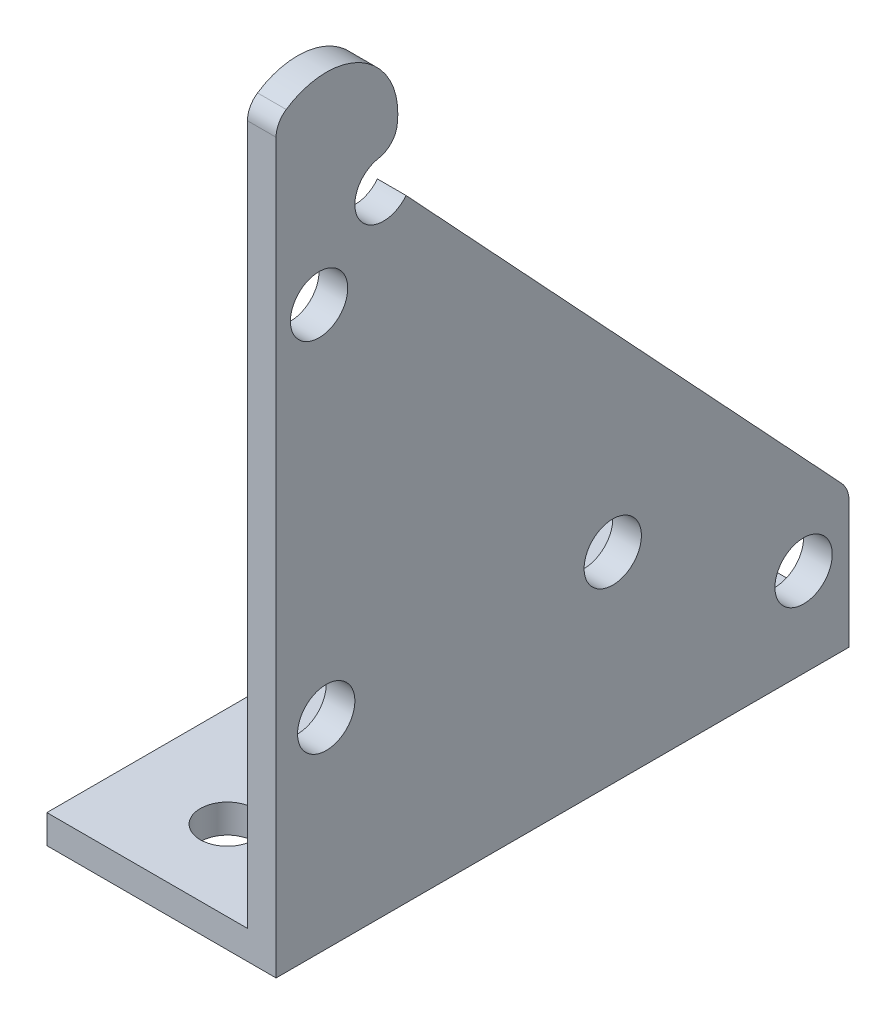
ISO-10303-21;
HEADER;
FILE_DESCRIPTION(('STEP AP214'),'2;1');
FILE_NAME('part.step','',(''),(''),'','','');
FILE_SCHEMA(('AUTOMOTIVE_DESIGN { 1 0 10303 214 1 1 1 1 }'));
ENDSEC;
DATA;
#1=APPLICATION_CONTEXT('core data for automotive mechanical design processes');
#2=APPLICATION_PROTOCOL_DEFINITION('international standard','automotive_design',2000,#1);
#3=PRODUCT_CONTEXT('',#1,'mechanical');
#4=PRODUCT('Part','Part','',(#3));
#5=PRODUCT_RELATED_PRODUCT_CATEGORY('part','',(#4));
#6=PRODUCT_DEFINITION_FORMATION('','',#4);
#7=PRODUCT_DEFINITION_CONTEXT('part definition',#1,'design');
#8=PRODUCT_DEFINITION('design','',#6,#7);
#9=PRODUCT_DEFINITION_SHAPE('','',#8);
#10=(LENGTH_UNIT() NAMED_UNIT(*) SI_UNIT(.MILLI.,.METRE.));
#11=(NAMED_UNIT(*) PLANE_ANGLE_UNIT() SI_UNIT($,.RADIAN.));
#12=(NAMED_UNIT(*) SI_UNIT($,.STERADIAN.) SOLID_ANGLE_UNIT());
#13=UNCERTAINTY_MEASURE_WITH_UNIT(LENGTH_MEASURE(1.E-05),#10,'distance_accuracy_value','');
#14=(GEOMETRIC_REPRESENTATION_CONTEXT(3) GLOBAL_UNCERTAINTY_ASSIGNED_CONTEXT((#13)) GLOBAL_UNIT_ASSIGNED_CONTEXT((#10,
#11,#12)) REPRESENTATION_CONTEXT('',''));
#15=CARTESIAN_POINT('',(0.,0.,0.));
#16=DIRECTION('',(0.,0.,1.));
#17=DIRECTION('',(1.,0.,0.));
#18=AXIS2_PLACEMENT_3D('',#15,#16,#17);
#19=CARTESIAN_POINT('',(3.175,0.,-63.5));
#20=DIRECTION('',(0.,0.,1.));
#21=DIRECTION('',(1.,0.,0.));
#22=AXIS2_PLACEMENT_3D('',#19,#20,#21);
#23=PLANE('',#22);
#24=DIRECTION('',(0.,1.,0.));
#25=VECTOR('',#24,1.);
#26=CARTESIAN_POINT('',(0.,0.,-63.5));
#27=LINE('',#26,#25);
#28=CARTESIAN_POINT('',(0.,3.175,-63.5));
#29=VERTEX_POINT('',#28);
#30=CARTESIAN_POINT('',(0.,13.9893342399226,-63.5));
#31=VERTEX_POINT('',#30);
#32=EDGE_CURVE('E153',#29,#31,#27,.T.);
#33=ORIENTED_EDGE('',*,*,#32,.T.);
#34=DIRECTION('',(-1.,0.,0.));
#35=VECTOR('',#34,1.);
#36=CARTESIAN_POINT('',(3.175,13.9893342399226,-63.5));
#37=LINE('',#36,#35);
#38=CARTESIAN_POINT('',(3.175,13.9893342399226,-63.5));
#39=VERTEX_POINT('',#38);
#40=EDGE_CURVE('E40',#31,#39,#37,.F.);
#41=ORIENTED_EDGE('',*,*,#40,.T.);
#42=DIRECTION('',(0.,1.,0.));
#43=VECTOR('',#42,1.);
#44=CARTESIAN_POINT('',(3.175,0.,-63.5));
#45=LINE('',#44,#43);
#46=CARTESIAN_POINT('',(3.175,0.,-63.5));
#47=VERTEX_POINT('',#46);
#48=EDGE_CURVE('E168',#47,#39,#45,.T.);
#49=ORIENTED_EDGE('',*,*,#48,.F.);
#50=DIRECTION('',(-1.,0.,0.));
#51=VECTOR('',#50,1.);
#52=CARTESIAN_POINT('',(3.175,0.,-63.5));
#53=LINE('',#52,#51);
#54=CARTESIAN_POINT('',(-22.225,0.,-63.5));
#55=VERTEX_POINT('',#54);
#56=EDGE_CURVE('E127',#47,#55,#53,.T.);
#57=ORIENTED_EDGE('',*,*,#56,.T.);
#58=DIRECTION('',(0.,-1.,0.));
#59=VECTOR('',#58,1.);
#60=CARTESIAN_POINT('',(-22.225,3.175,-63.5));
#61=LINE('',#60,#59);
#62=CARTESIAN_POINT('',(-22.225,3.175,-63.5));
#63=VERTEX_POINT('',#62);
#64=EDGE_CURVE('E135',#63,#55,#61,.T.);
#65=ORIENTED_EDGE('',*,*,#64,.F.);
#66=DIRECTION('',(-1.,0.,0.));
#67=VECTOR('',#66,1.);
#68=CARTESIAN_POINT('',(3.175,3.175,-63.5));
#69=LINE('',#68,#67);
#70=EDGE_CURVE('E137',#29,#63,#69,.T.);
#71=ORIENTED_EDGE('',*,*,#70,.F.);
#72=EDGE_LOOP('',(#33,#41,#49,#57,#65,#71));
#73=FACE_BOUND('',#72,.T.);
#74=ADVANCED_FACE('F33',(#73),#23,.F.);
#75=CARTESIAN_POINT('',(3.175,15.24,-63.5));
#76=DIRECTION('',(0.,-0.681998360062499,0.731353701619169));
#77=DIRECTION('',(0.,-0.73135370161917,-0.6819983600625));
#78=AXIS2_PLACEMENT_3D('',#75,#76,#77);
#79=PLANE('',#78);
#80=DIRECTION('',(0.,0.73135370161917,0.6819983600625));
#81=VECTOR('',#80,1.);
#82=CARTESIAN_POINT('',(3.175,15.24,-63.5));
#83=LINE('',#82,#81);
#84=CARTESIAN_POINT('',(3.175,16.154679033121,-62.6470480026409));
#85=VERTEX_POINT('',#84);
#86=CARTESIAN_POINT('',(3.175,67.8901727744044,-14.4029196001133));
#87=VERTEX_POINT('',#86);
#88=EDGE_CURVE('E170',#85,#87,#83,.T.);
#89=ORIENTED_EDGE('',*,*,#88,.F.);
#90=DIRECTION('',(-1.,0.,0.));
#91=VECTOR('',#90,1.);
#92=CARTESIAN_POINT('',(3.175,16.154679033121,-62.6470480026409));
#93=LINE('',#92,#91);
#94=CARTESIAN_POINT('',(0.,16.154679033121,-62.6470480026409));
#95=VERTEX_POINT('',#94);
#96=EDGE_CURVE('E200',#85,#95,#93,.T.);
#97=ORIENTED_EDGE('',*,*,#96,.T.);
#98=DIRECTION('',(0.,0.73135370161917,0.6819983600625));
#99=VECTOR('',#98,1.);
#100=CARTESIAN_POINT('',(0.,15.24,-63.5));
#101=LINE('',#100,#99);
#102=CARTESIAN_POINT('',(0.,67.8901727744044,-14.4029196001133));
#103=VERTEX_POINT('',#102);
#104=EDGE_CURVE('E156',#95,#103,#101,.T.);
#105=ORIENTED_EDGE('',*,*,#104,.T.);
#106=DIRECTION('',(-1.,0.,0.));
#107=VECTOR('',#106,1.);
#108=CARTESIAN_POINT('',(3.175,67.8901727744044,-14.4029196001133));
#109=LINE('',#108,#107);
#110=EDGE_CURVE('E195',#87,#103,#109,.T.);
#111=ORIENTED_EDGE('',*,*,#110,.F.);
#112=EDGE_LOOP('',(#89,#97,#105,#111));
#113=FACE_BOUND('',#112,.T.);
#114=ADVANCED_FACE('F206',(#113),#79,.F.);
#115=CARTESIAN_POINT('',(3.175,69.85,-11.90498));
#116=DIRECTION('',(-1.,0.,0.));
#117=DIRECTION('',(0.,0.,1.));
#118=AXIS2_PLACEMENT_3D('',#115,#116,#117);
#119=CYLINDRICAL_SURFACE('',#118,3.17499999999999);
#120=CARTESIAN_POINT('',(0.,69.85,-11.90498));
#121=DIRECTION('',(-1.,0.,0.));
#122=DIRECTION('',(0.,0.,1.));
#123=AXIS2_PLACEMENT_3D('',#120,#121,#122);
#124=CIRCLE('',#123,3.17499999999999);
#125=CARTESIAN_POINT('',(0.,72.9758991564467,-11.3487611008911));
#126=VERTEX_POINT('',#125);
#127=EDGE_CURVE('E158',#103,#126,#124,.T.);
#128=ORIENTED_EDGE('',*,*,#127,.T.);
#129=DIRECTION('',(-1.,0.,0.));
#130=VECTOR('',#129,1.);
#131=CARTESIAN_POINT('',(3.175,72.9758991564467,-11.3487611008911));
#132=LINE('',#131,#130);
#133=CARTESIAN_POINT('',(3.175,72.9758991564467,-11.3487611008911));
#134=VERTEX_POINT('',#133);
#135=EDGE_CURVE('E192',#134,#126,#132,.T.);
#136=ORIENTED_EDGE('',*,*,#135,.F.);
#137=CARTESIAN_POINT('',(3.175,69.85,-11.90498));
#138=DIRECTION('',(-1.,0.,0.));
#139=DIRECTION('',(0.,0.,1.));
#140=AXIS2_PLACEMENT_3D('',#137,#138,#139);
#141=CIRCLE('',#140,3.17499999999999);
#142=EDGE_CURVE('E172',#87,#134,#141,.T.);
#143=ORIENTED_EDGE('',*,*,#142,.F.);
#144=ORIENTED_EDGE('',*,*,#110,.T.);
#145=EDGE_LOOP('',(#128,#136,#143,#144));
#146=FACE_BOUND('',#145,.T.);
#147=ADVANCED_FACE('F216',(#146),#119,.F.);
#148=CARTESIAN_POINT('',(3.175,75.476618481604,-10.903785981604));
#149=DIRECTION('',(-1.,0.,0.));
#150=DIRECTION('',(0.,0.,1.));
#151=AXIS2_PLACEMENT_3D('',#148,#149,#150);
#152=CYLINDRICAL_SURFACE('',#151,2.54);
#153=CARTESIAN_POINT('',(0.,75.476618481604,-10.903785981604));
#154=DIRECTION('',(1.,0.,0.));
#155=DIRECTION('',(0.,0.,1.));
#156=AXIS2_PLACEMENT_3D('',#153,#154,#155);
#157=CIRCLE('',#156,2.54);
#158=CARTESIAN_POINT('',(0.,75.1362036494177,-13.4208711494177));
#159=VERTEX_POINT('',#158);
#160=EDGE_CURVE('E160',#126,#159,#157,.T.);
#161=ORIENTED_EDGE('',*,*,#160,.T.);
#162=DIRECTION('',(-1.,0.,0.));
#163=VECTOR('',#162,1.);
#164=CARTESIAN_POINT('',(3.175,75.1362036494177,-13.4208711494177));
#165=LINE('',#164,#163);
#166=CARTESIAN_POINT('',(3.175,75.1362036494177,-13.4208711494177));
#167=VERTEX_POINT('',#166);
#168=EDGE_CURVE('E189',#167,#159,#165,.T.);
#169=ORIENTED_EDGE('',*,*,#168,.F.);
#170=CARTESIAN_POINT('',(3.175,75.476618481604,-10.903785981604));
#171=DIRECTION('',(1.,0.,0.));
#172=DIRECTION('',(0.,0.,1.));
#173=AXIS2_PLACEMENT_3D('',#170,#171,#172);
#174=CIRCLE('',#173,2.54);
#175=EDGE_CURVE('E174',#134,#167,#174,.T.);
#176=ORIENTED_EDGE('',*,*,#175,.F.);
#177=ORIENTED_EDGE('',*,*,#135,.T.);
#178=EDGE_LOOP('',(#161,#169,#176,#177));
#179=FACE_BOUND('',#178,.T.);
#180=ADVANCED_FACE('F220',(#179),#152,.T.);
#181=CARTESIAN_POINT('',(3.175,76.2,-5.55498));
#182=DIRECTION('',(-1.,0.,0.));
#183=DIRECTION('',(0.,0.,1.));
#184=AXIS2_PLACEMENT_3D('',#181,#182,#183);
#185=CYLINDRICAL_SURFACE('',#184,7.9375);
#186=CARTESIAN_POINT('',(0.,76.2,-5.55498));
#187=DIRECTION('',(1.,0.,0.));
#188=DIRECTION('',(0.,0.,1.));
#189=AXIS2_PLACEMENT_3D('',#186,#187,#188);
#190=CIRCLE('',#189,7.9375);
#191=CARTESIAN_POINT('',(0.,82.7837205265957,-1.12118588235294));
#192=VERTEX_POINT('',#191);
#193=EDGE_CURVE('E162',#159,#192,#190,.T.);
#194=ORIENTED_EDGE('',*,*,#193,.T.);
#195=DIRECTION('',(-1.,0.,0.));
#196=VECTOR('',#195,1.);
#197=CARTESIAN_POINT('',(3.175,82.7837205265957,-1.12118588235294));
#198=LINE('',#197,#196);
#199=CARTESIAN_POINT('',(3.175,82.7837205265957,-1.12118588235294));
#200=VERTEX_POINT('',#199);
#201=EDGE_CURVE('E186',#200,#192,#198,.T.);
#202=ORIENTED_EDGE('',*,*,#201,.F.);
#203=CARTESIAN_POINT('',(3.175,76.2,-5.55498));
#204=DIRECTION('',(1.,0.,0.));
#205=DIRECTION('',(0.,0.,1.));
#206=AXIS2_PLACEMENT_3D('',#203,#204,#205);
#207=CIRCLE('',#206,7.9375);
#208=EDGE_CURVE('E176',#167,#200,#207,.T.);
#209=ORIENTED_EDGE('',*,*,#208,.F.);
#210=ORIENTED_EDGE('',*,*,#168,.T.);
#211=EDGE_LOOP('',(#194,#202,#209,#210));
#212=FACE_BOUND('',#211,.T.);
#213=ADVANCED_FACE('F254',(#212),#185,.T.);
#214=CARTESIAN_POINT('',(3.175,80.6769299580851,-2.54));
#215=DIRECTION('',(-1.,0.,0.));
#216=DIRECTION('',(0.,0.,1.));
#217=AXIS2_PLACEMENT_3D('',#214,#215,#216);
#218=CYLINDRICAL_SURFACE('',#217,2.54);
#219=CARTESIAN_POINT('',(0.,80.6769299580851,-2.54));
#220=DIRECTION('',(1.,0.,0.));
#221=DIRECTION('',(0.,0.,-1.));
#222=AXIS2_PLACEMENT_3D('',#219,#220,#221);
#223=CIRCLE('',#222,2.54);
#224=CARTESIAN_POINT('',(0.,80.6769299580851,0.));
#225=VERTEX_POINT('',#224);
#226=EDGE_CURVE('E164',#192,#225,#223,.T.);
#227=ORIENTED_EDGE('',*,*,#226,.T.);
#228=DIRECTION('',(-1.,0.,0.));
#229=VECTOR('',#228,1.);
#230=CARTESIAN_POINT('',(3.175,80.6769299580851,0.));
#231=LINE('',#230,#229);
#232=CARTESIAN_POINT('',(3.175,80.6769299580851,0.));
#233=VERTEX_POINT('',#232);
#234=EDGE_CURVE('E126',#233,#225,#231,.T.);
#235=ORIENTED_EDGE('',*,*,#234,.F.);
#236=CARTESIAN_POINT('',(3.175,80.6769299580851,-2.54));
#237=DIRECTION('',(1.,0.,0.));
#238=DIRECTION('',(0.,0.,-1.));
#239=AXIS2_PLACEMENT_3D('',#236,#237,#238);
#240=CIRCLE('',#239,2.54);
#241=EDGE_CURVE('E178',#200,#233,#240,.T.);
#242=ORIENTED_EDGE('',*,*,#241,.F.);
#243=ORIENTED_EDGE('',*,*,#201,.T.);
#244=EDGE_LOOP('',(#227,#235,#242,#243));
#245=FACE_BOUND('',#244,.T.);
#246=ADVANCED_FACE('F252',(#245),#218,.T.);
#247=CARTESIAN_POINT('',(3.175,0.,0.));
#248=DIRECTION('',(0.,0.,-1.));
#249=DIRECTION('',(-1.,0.,0.));
#250=AXIS2_PLACEMENT_3D('',#247,#248,#249);
#251=PLANE('',#250);
#252=DIRECTION('',(0.,-1.,0.));
#253=VECTOR('',#252,1.);
#254=CARTESIAN_POINT('',(0.,0.,0.));
#255=LINE('',#254,#253);
#256=CARTESIAN_POINT('',(0.,3.175,0.));
#257=VERTEX_POINT('',#256);
#258=EDGE_CURVE('E166',#225,#257,#255,.T.);
#259=ORIENTED_EDGE('',*,*,#258,.T.);
#260=DIRECTION('',(-1.,0.,0.));
#261=VECTOR('',#260,1.);
#262=CARTESIAN_POINT('',(3.175,3.175,0.));
#263=LINE('',#262,#261);
#264=CARTESIAN_POINT('',(-22.225,3.175,0.));
#265=VERTEX_POINT('',#264);
#266=EDGE_CURVE('E141',#257,#265,#263,.T.);
#267=ORIENTED_EDGE('',*,*,#266,.T.);
#268=DIRECTION('',(0.,-1.,0.));
#269=VECTOR('',#268,1.);
#270=CARTESIAN_POINT('',(-22.225,3.175,0.));
#271=LINE('',#270,#269);
#272=CARTESIAN_POINT('',(-22.225,0.,0.));
#273=VERTEX_POINT('',#272);
#274=EDGE_CURVE('E133',#265,#273,#271,.T.);
#275=ORIENTED_EDGE('',*,*,#274,.T.);
#276=DIRECTION('',(-1.,0.,0.));
#277=VECTOR('',#276,1.);
#278=CARTESIAN_POINT('',(3.175,0.,0.));
#279=LINE('',#278,#277);
#280=CARTESIAN_POINT('',(3.175,0.,0.));
#281=VERTEX_POINT('',#280);
#282=EDGE_CURVE('E116',#281,#273,#279,.T.);
#283=ORIENTED_EDGE('',*,*,#282,.F.);
#284=DIRECTION('',(0.,-1.,0.));
#285=VECTOR('',#284,1.);
#286=CARTESIAN_POINT('',(3.175,0.,0.));
#287=LINE('',#286,#285);
#288=EDGE_CURVE('E180',#233,#281,#287,.T.);
#289=ORIENTED_EDGE('',*,*,#288,.F.);
#290=ORIENTED_EDGE('',*,*,#234,.T.);
#291=EDGE_LOOP('',(#259,#267,#275,#283,#289,#290));
#292=FACE_BOUND('',#291,.T.);
#293=ADVANCED_FACE('F140',(#292),#251,.F.);
#294=CARTESIAN_POINT('',(3.175,0.,-63.5));
#295=DIRECTION('',(0.,1.,0.));
#296=DIRECTION('',(0.,0.,1.));
#297=AXIS2_PLACEMENT_3D('',#294,#295,#296);
#298=PLANE('',#297);
#299=CARTESIAN_POINT('',(-11.1125,0.,-54.61));
#300=DIRECTION('',(0.,1.,0.));
#301=DIRECTION('',(0.,0.,1.));
#302=AXIS2_PLACEMENT_3D('',#299,#300,#301);
#303=CIRCLE('',#302,3.);
#304=CARTESIAN_POINT('',(-11.1125,0.,-51.61));
#305=VERTEX_POINT('',#304);
#306=EDGE_CURVE('E422',#305,#305,#303,.T.);
#307=ORIENTED_EDGE('',*,*,#306,.T.);
#308=EDGE_LOOP('',(#307));
#309=FACE_BOUND('',#308,.T.);
#310=CARTESIAN_POINT('',(-11.1125,0.,-31.75));
#311=DIRECTION('',(0.,1.,0.));
#312=DIRECTION('',(0.,0.,1.));
#313=AXIS2_PLACEMENT_3D('',#310,#311,#312);
#314=CIRCLE('',#313,3.);
#315=CARTESIAN_POINT('',(-11.1125,0.,-28.75));
#316=VERTEX_POINT('',#315);
#317=EDGE_CURVE('E426',#316,#316,#314,.T.);
#318=ORIENTED_EDGE('',*,*,#317,.T.);
#319=EDGE_LOOP('',(#318));
#320=FACE_BOUND('',#319,.T.);
#321=CARTESIAN_POINT('',(-11.1125,0.,-8.89));
#322=DIRECTION('',(0.,1.,0.));
#323=DIRECTION('',(0.,0.,1.));
#324=AXIS2_PLACEMENT_3D('',#321,#322,#323);
#325=CIRCLE('',#324,3.);
#326=CARTESIAN_POINT('',(-11.1125,0.,-5.89000000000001));
#327=VERTEX_POINT('',#326);
#328=EDGE_CURVE('E435',#327,#327,#325,.T.);
#329=ORIENTED_EDGE('',*,*,#328,.T.);
#330=EDGE_LOOP('',(#329));
#331=FACE_BOUND('',#330,.T.);
#332=ORIENTED_EDGE('',*,*,#282,.T.);
#333=DIRECTION('',(0.,0.,1.));
#334=VECTOR('',#333,1.);
#335=CARTESIAN_POINT('',(-22.225,0.,-63.5));
#336=LINE('',#335,#334);
#337=EDGE_CURVE('E120',#55,#273,#336,.T.);
#338=ORIENTED_EDGE('',*,*,#337,.F.);
#339=ORIENTED_EDGE('',*,*,#56,.F.);
#340=DIRECTION('',(0.,0.,-1.));
#341=VECTOR('',#340,1.);
#342=CARTESIAN_POINT('',(3.175,0.,-63.5));
#343=LINE('',#342,#341);
#344=EDGE_CURVE('E122',#281,#47,#343,.T.);
#345=ORIENTED_EDGE('',*,*,#344,.F.);
#346=EDGE_LOOP('',(#332,#338,#339,#345));
#347=FACE_BOUND('',#346,.T.);
#348=ADVANCED_FACE('F118',(#309,#320,#331,#347),#298,.F.);
#349=CARTESIAN_POINT('',(3.175,69.85,-11.90498));
#350=DIRECTION('',(-1.,0.,0.));
#351=DIRECTION('',(0.,0.,1.));
#352=AXIS2_PLACEMENT_3D('',#349,#350,#351);
#353=PLANE('',#352);
#354=CARTESIAN_POINT('',(3.175,62.23,-4.7625));
#355=DIRECTION('',(-1.,0.,0.));
#356=DIRECTION('',(0.,0.,1.));
#357=AXIS2_PLACEMENT_3D('',#354,#355,#356);
#358=CIRCLE('',#357,3.175);
#359=CARTESIAN_POINT('',(3.175,62.23,-1.5875));
#360=VERTEX_POINT('',#359);
#361=EDGE_CURVE('E441',#360,#360,#358,.T.);
#362=ORIENTED_EDGE('',*,*,#361,.T.);
#363=EDGE_LOOP('',(#362));
#364=FACE_BOUND('',#363,.T.);
#365=CARTESIAN_POINT('',(3.175,9.8425,-58.45175));
#366=DIRECTION('',(-1.,0.,0.));
#367=DIRECTION('',(0.,0.,1.));
#368=AXIS2_PLACEMENT_3D('',#365,#366,#367);
#369=CIRCLE('',#368,3.175);
#370=CARTESIAN_POINT('',(3.175,9.8425,-55.27675));
#371=VERTEX_POINT('',#370);
#372=EDGE_CURVE('E447',#371,#371,#369,.T.);
#373=ORIENTED_EDGE('',*,*,#372,.T.);
#374=EDGE_LOOP('',(#373));
#375=FACE_BOUND('',#374,.T.);
#376=CARTESIAN_POINT('',(3.175,22.225,-37.30498));
#377=DIRECTION('',(-1.,0.,0.));
#378=DIRECTION('',(0.,0.,1.));
#379=AXIS2_PLACEMENT_3D('',#376,#377,#378);
#380=CIRCLE('',#379,3.175);
#381=CARTESIAN_POINT('',(3.175,22.225,-34.12998));
#382=VERTEX_POINT('',#381);
#383=EDGE_CURVE('E453',#382,#382,#380,.T.);
#384=ORIENTED_EDGE('',*,*,#383,.T.);
#385=EDGE_LOOP('',(#384));
#386=FACE_BOUND('',#385,.T.);
#387=CARTESIAN_POINT('',(3.175,22.225,-5.55498));
#388=DIRECTION('',(-1.,0.,0.));
#389=DIRECTION('',(0.,0.,1.));
#390=AXIS2_PLACEMENT_3D('',#387,#388,#389);
#391=CIRCLE('',#390,3.175);
#392=CARTESIAN_POINT('',(3.175,22.225,-2.37998));
#393=VERTEX_POINT('',#392);
#394=EDGE_CURVE('E143',#393,#393,#391,.T.);
#395=ORIENTED_EDGE('',*,*,#394,.T.);
#396=EDGE_LOOP('',(#395));
#397=FACE_BOUND('',#396,.T.);
#398=ORIENTED_EDGE('',*,*,#48,.T.);
#399=CARTESIAN_POINT('',(3.175,13.9893342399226,-60.325));
#400=DIRECTION('',(-1.,0.,0.));
#401=DIRECTION('',(0.,0.,1.));
#402=AXIS2_PLACEMENT_3D('',#399,#400,#401);
#403=CIRCLE('',#402,3.175);
#404=EDGE_CURVE('E11',#39,#85,#403,.F.);
#405=ORIENTED_EDGE('',*,*,#404,.T.);
#406=ORIENTED_EDGE('',*,*,#88,.T.);
#407=ORIENTED_EDGE('',*,*,#142,.T.);
#408=ORIENTED_EDGE('',*,*,#175,.T.);
#409=ORIENTED_EDGE('',*,*,#208,.T.);
#410=ORIENTED_EDGE('',*,*,#241,.T.);
#411=ORIENTED_EDGE('',*,*,#288,.T.);
#412=ORIENTED_EDGE('',*,*,#344,.T.);
#413=EDGE_LOOP('',(#398,#405,#406,#407,#408,#409,#410,#411,#412));
#414=FACE_BOUND('',#413,.T.);
#415=ADVANCED_FACE('F224',(#364,#375,#386,#397,#414),#353,.F.);
#416=CARTESIAN_POINT('',(0.,69.85,-11.90498));
#417=DIRECTION('',(-1.,0.,0.));
#418=DIRECTION('',(0.,0.,1.));
#419=AXIS2_PLACEMENT_3D('',#416,#417,#418);
#420=PLANE('',#419);
#421=CARTESIAN_POINT('',(0.,62.23,-4.7625));
#422=DIRECTION('',(-1.,0.,0.));
#423=DIRECTION('',(0.,0.,1.));
#424=AXIS2_PLACEMENT_3D('',#421,#422,#423);
#425=CIRCLE('',#424,3.175);
#426=CARTESIAN_POINT('',(0.,62.23,-1.5875));
#427=VERTEX_POINT('',#426);
#428=EDGE_CURVE('E438',#427,#427,#425,.T.);
#429=ORIENTED_EDGE('',*,*,#428,.F.);
#430=EDGE_LOOP('',(#429));
#431=FACE_BOUND('',#430,.T.);
#432=CARTESIAN_POINT('',(0.,9.8425,-58.45175));
#433=DIRECTION('',(-1.,0.,0.));
#434=DIRECTION('',(0.,0.,1.));
#435=AXIS2_PLACEMENT_3D('',#432,#433,#434);
#436=CIRCLE('',#435,3.175);
#437=CARTESIAN_POINT('',(0.,9.8425,-55.27675));
#438=VERTEX_POINT('',#437);
#439=EDGE_CURVE('E444',#438,#438,#436,.T.);
#440=ORIENTED_EDGE('',*,*,#439,.F.);
#441=EDGE_LOOP('',(#440));
#442=FACE_BOUND('',#441,.T.);
#443=CARTESIAN_POINT('',(0.,22.225,-37.30498));
#444=DIRECTION('',(-1.,0.,0.));
#445=DIRECTION('',(0.,0.,1.));
#446=AXIS2_PLACEMENT_3D('',#443,#444,#445);
#447=CIRCLE('',#446,3.175);
#448=CARTESIAN_POINT('',(0.,22.225,-34.12998));
#449=VERTEX_POINT('',#448);
#450=EDGE_CURVE('E450',#449,#449,#447,.T.);
#451=ORIENTED_EDGE('',*,*,#450,.F.);
#452=EDGE_LOOP('',(#451));
#453=FACE_BOUND('',#452,.T.);
#454=CARTESIAN_POINT('',(0.,22.225,-5.55498));
#455=DIRECTION('',(-1.,0.,0.));
#456=DIRECTION('',(0.,0.,1.));
#457=AXIS2_PLACEMENT_3D('',#454,#455,#456);
#458=CIRCLE('',#457,3.175);
#459=CARTESIAN_POINT('',(0.,22.225,-2.37998));
#460=VERTEX_POINT('',#459);
#461=EDGE_CURVE('E147',#460,#460,#458,.T.);
#462=ORIENTED_EDGE('',*,*,#461,.F.);
#463=EDGE_LOOP('',(#462));
#464=FACE_BOUND('',#463,.T.);
#465=ORIENTED_EDGE('',*,*,#104,.F.);
#466=CARTESIAN_POINT('',(0.,13.9893342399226,-60.325));
#467=DIRECTION('',(-1.,0.,0.));
#468=DIRECTION('',(0.,0.,1.));
#469=AXIS2_PLACEMENT_3D('',#466,#467,#468);
#470=CIRCLE('',#469,3.175);
#471=EDGE_CURVE('E54',#95,#31,#470,.T.);
#472=ORIENTED_EDGE('',*,*,#471,.T.);
#473=ORIENTED_EDGE('',*,*,#32,.F.);
#474=DIRECTION('',(0.,0.,-1.));
#475=VECTOR('',#474,1.);
#476=CARTESIAN_POINT('',(0.,3.175,-11.90498));
#477=LINE('',#476,#475);
#478=EDGE_CURVE('E198',#257,#29,#477,.T.);
#479=ORIENTED_EDGE('',*,*,#478,.F.);
#480=ORIENTED_EDGE('',*,*,#258,.F.);
#481=ORIENTED_EDGE('',*,*,#226,.F.);
#482=ORIENTED_EDGE('',*,*,#193,.F.);
#483=ORIENTED_EDGE('',*,*,#160,.F.);
#484=ORIENTED_EDGE('',*,*,#127,.F.);
#485=EDGE_LOOP('',(#465,#472,#473,#479,#480,#481,#482,#483,#484));
#486=FACE_BOUND('',#485,.T.);
#487=ADVANCED_FACE('F211',(#431,#442,#453,#464,#486),#420,.T.);
#488=CARTESIAN_POINT('',(-22.225,3.175,-63.5));
#489=DIRECTION('',(-1.,0.,0.));
#490=DIRECTION('',(0.,-1.,0.));
#491=AXIS2_PLACEMENT_3D('',#488,#489,#490);
#492=PLANE('',#491);
#493=ORIENTED_EDGE('',*,*,#274,.F.);
#494=DIRECTION('',(0.,0.,1.));
#495=VECTOR('',#494,1.);
#496=CARTESIAN_POINT('',(-22.225,3.175,-63.5));
#497=LINE('',#496,#495);
#498=EDGE_CURVE('E136',#63,#265,#497,.T.);
#499=ORIENTED_EDGE('',*,*,#498,.F.);
#500=ORIENTED_EDGE('',*,*,#64,.T.);
#501=ORIENTED_EDGE('',*,*,#337,.T.);
#502=EDGE_LOOP('',(#493,#499,#500,#501));
#503=FACE_BOUND('',#502,.T.);
#504=ADVANCED_FACE('F131',(#503),#492,.T.);
#505=CARTESIAN_POINT('',(3.175,3.175,-63.5));
#506=DIRECTION('',(0.,1.,0.));
#507=DIRECTION('',(-1.,0.,0.));
#508=AXIS2_PLACEMENT_3D('',#505,#506,#507);
#509=PLANE('',#508);
#510=CARTESIAN_POINT('',(-11.1125,3.175,-54.61));
#511=DIRECTION('',(0.,1.,0.));
#512=DIRECTION('',(0.,0.,1.));
#513=AXIS2_PLACEMENT_3D('',#510,#511,#512);
#514=CIRCLE('',#513,3.);
#515=CARTESIAN_POINT('',(-11.1125,3.175,-51.61));
#516=VERTEX_POINT('',#515);
#517=EDGE_CURVE('E419',#516,#516,#514,.T.);
#518=ORIENTED_EDGE('',*,*,#517,.F.);
#519=EDGE_LOOP('',(#518));
#520=FACE_BOUND('',#519,.T.);
#521=CARTESIAN_POINT('',(-11.1125,3.175,-31.75));
#522=DIRECTION('',(0.,1.,0.));
#523=DIRECTION('',(0.,0.,1.));
#524=AXIS2_PLACEMENT_3D('',#521,#522,#523);
#525=CIRCLE('',#524,3.);
#526=CARTESIAN_POINT('',(-11.1125,3.175,-28.75));
#527=VERTEX_POINT('',#526);
#528=EDGE_CURVE('E423',#527,#527,#525,.T.);
#529=ORIENTED_EDGE('',*,*,#528,.F.);
#530=EDGE_LOOP('',(#529));
#531=FACE_BOUND('',#530,.T.);
#532=CARTESIAN_POINT('',(-11.1125,3.175,-8.89));
#533=DIRECTION('',(0.,1.,0.));
#534=DIRECTION('',(0.,0.,1.));
#535=AXIS2_PLACEMENT_3D('',#532,#533,#534);
#536=CIRCLE('',#535,3.);
#537=CARTESIAN_POINT('',(-11.1125,3.175,-5.89000000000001));
#538=VERTEX_POINT('',#537);
#539=EDGE_CURVE('E432',#538,#538,#536,.T.);
#540=ORIENTED_EDGE('',*,*,#539,.F.);
#541=EDGE_LOOP('',(#540));
#542=FACE_BOUND('',#541,.T.);
#543=ORIENTED_EDGE('',*,*,#266,.F.);
#544=ORIENTED_EDGE('',*,*,#478,.T.);
#545=ORIENTED_EDGE('',*,*,#70,.T.);
#546=ORIENTED_EDGE('',*,*,#498,.T.);
#547=EDGE_LOOP('',(#543,#544,#545,#546));
#548=FACE_BOUND('',#547,.T.);
#549=ADVANCED_FACE('F229',(#520,#531,#542,#548),#509,.T.);
#550=CARTESIAN_POINT('',(3.175,13.9893342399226,-60.325));
#551=DIRECTION('',(-1.,0.,0.));
#552=DIRECTION('',(0.,0.,1.));
#553=AXIS2_PLACEMENT_3D('',#550,#551,#552);
#554=CYLINDRICAL_SURFACE('',#553,3.175);
#555=ORIENTED_EDGE('',*,*,#404,.F.);
#556=ORIENTED_EDGE('',*,*,#40,.F.);
#557=ORIENTED_EDGE('',*,*,#471,.F.);
#558=ORIENTED_EDGE('',*,*,#96,.F.);
#559=EDGE_LOOP('',(#555,#556,#557,#558));
#560=FACE_BOUND('',#559,.T.);
#561=ADVANCED_FACE('F226',(#560),#554,.T.);
#562=CARTESIAN_POINT('',(6.35,22.225,-5.55498));
#563=DIRECTION('',(-1.,0.,0.));
#564=DIRECTION('',(0.,0.,1.));
#565=AXIS2_PLACEMENT_3D('',#562,#563,#564);
#566=CYLINDRICAL_SURFACE('',#565,3.175);
#567=ORIENTED_EDGE('',*,*,#461,.T.);
#568=EDGE_LOOP('',(#567));
#569=FACE_BOUND('',#568,.T.);
#570=ORIENTED_EDGE('',*,*,#394,.F.);
#571=EDGE_LOOP('',(#570));
#572=FACE_BOUND('',#571,.T.);
#573=ADVANCED_FACE('F228',(#569,#572),#566,.F.);
#574=CARTESIAN_POINT('',(6.35,22.225,-37.30498));
#575=DIRECTION('',(-1.,0.,0.));
#576=DIRECTION('',(0.,0.,1.));
#577=AXIS2_PLACEMENT_3D('',#574,#575,#576);
#578=CYLINDRICAL_SURFACE('',#577,3.175);
#579=ORIENTED_EDGE('',*,*,#450,.T.);
#580=EDGE_LOOP('',(#579));
#581=FACE_BOUND('',#580,.T.);
#582=ORIENTED_EDGE('',*,*,#383,.F.);
#583=EDGE_LOOP('',(#582));
#584=FACE_BOUND('',#583,.T.);
#585=ADVANCED_FACE('F235',(#581,#584),#578,.F.);
#586=CARTESIAN_POINT('',(6.35,9.8425,-58.45175));
#587=DIRECTION('',(-1.,0.,0.));
#588=DIRECTION('',(0.,0.,1.));
#589=AXIS2_PLACEMENT_3D('',#586,#587,#588);
#590=CYLINDRICAL_SURFACE('',#589,3.175);
#591=ORIENTED_EDGE('',*,*,#439,.T.);
#592=EDGE_LOOP('',(#591));
#593=FACE_BOUND('',#592,.T.);
#594=ORIENTED_EDGE('',*,*,#372,.F.);
#595=EDGE_LOOP('',(#594));
#596=FACE_BOUND('',#595,.T.);
#597=ADVANCED_FACE('F350',(#593,#596),#590,.F.);
#598=CARTESIAN_POINT('',(6.35,62.23,-4.7625));
#599=DIRECTION('',(-1.,0.,0.));
#600=DIRECTION('',(0.,0.,1.));
#601=AXIS2_PLACEMENT_3D('',#598,#599,#600);
#602=CYLINDRICAL_SURFACE('',#601,3.175);
#603=ORIENTED_EDGE('',*,*,#428,.T.);
#604=EDGE_LOOP('',(#603));
#605=FACE_BOUND('',#604,.T.);
#606=ORIENTED_EDGE('',*,*,#361,.F.);
#607=EDGE_LOOP('',(#606));
#608=FACE_BOUND('',#607,.T.);
#609=ADVANCED_FACE('F360',(#605,#608),#602,.F.);
#610=CARTESIAN_POINT('',(-11.1125,3.175,-8.89));
#611=DIRECTION('',(0.,1.,0.));
#612=DIRECTION('',(0.,0.,1.));
#613=AXIS2_PLACEMENT_3D('',#610,#611,#612);
#614=CYLINDRICAL_SURFACE('',#613,3.);
#615=ORIENTED_EDGE('',*,*,#539,.T.);
#616=EDGE_LOOP('',(#615));
#617=FACE_BOUND('',#616,.T.);
#618=ORIENTED_EDGE('',*,*,#328,.F.);
#619=EDGE_LOOP('',(#618));
#620=FACE_BOUND('',#619,.T.);
#621=ADVANCED_FACE('F370',(#617,#620),#614,.F.);
#622=CARTESIAN_POINT('',(-11.1125,3.175,-31.75));
#623=DIRECTION('',(0.,1.,0.));
#624=DIRECTION('',(0.,0.,1.));
#625=AXIS2_PLACEMENT_3D('',#622,#623,#624);
#626=CYLINDRICAL_SURFACE('',#625,3.);
#627=ORIENTED_EDGE('',*,*,#528,.T.);
#628=EDGE_LOOP('',(#627));
#629=FACE_BOUND('',#628,.T.);
#630=ORIENTED_EDGE('',*,*,#317,.F.);
#631=EDGE_LOOP('',(#630));
#632=FACE_BOUND('',#631,.T.);
#633=ADVANCED_FACE('F392',(#629,#632),#626,.F.);
#634=CARTESIAN_POINT('',(-11.1125,3.175,-54.61));
#635=DIRECTION('',(0.,1.,0.));
#636=DIRECTION('',(0.,0.,1.));
#637=AXIS2_PLACEMENT_3D('',#634,#635,#636);
#638=CYLINDRICAL_SURFACE('',#637,3.);
#639=ORIENTED_EDGE('',*,*,#517,.T.);
#640=EDGE_LOOP('',(#639));
#641=FACE_BOUND('',#640,.T.);
#642=ORIENTED_EDGE('',*,*,#306,.F.);
#643=EDGE_LOOP('',(#642));
#644=FACE_BOUND('',#643,.T.);
#645=ADVANCED_FACE('F402',(#641,#644),#638,.F.);
#646=CLOSED_SHELL('',(#74,#114,#147,#180,#213,#246,#293,#348,#415,#487,#504,#549,#561,#573,#585,
#597,#609,#621,#633,#645));
#647=MANIFOLD_SOLID_BREP('B2',#646);
#648=ADVANCED_BREP_SHAPE_REPRESENTATION('',(#18,#647),#14);
#649=SHAPE_DEFINITION_REPRESENTATION(#9,#648);
ENDSEC;
END-ISO-10303-21;
